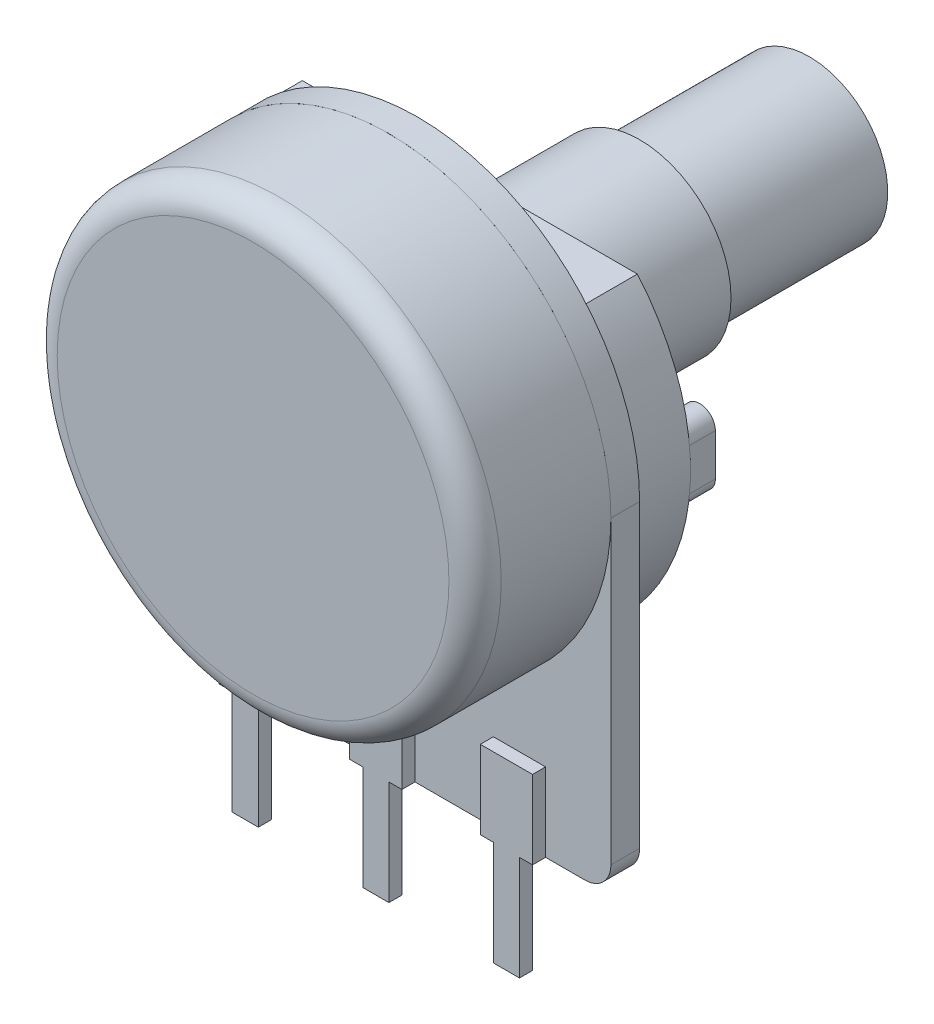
from build123d import *

# Parameters (mm, degrees)
SKETCH_1_R          = 8.5
EXTRUDE_1_DEPTH     = 5.2
FILLET_1_R          = 1
EXTRUDE_8_DEPTH     = 1.1
FILLET_2_R          = 1
EXTRUDE_2_DEPTH     = 2
SKETCH_3_R          = 3
EXTRUDE_7_DEPTH     = 15
EXTRUDE_9_DEPTH     = 0.5
EXTRUDE_9_2_DEPTH   = 0.5
EXTRUDE_9_3_DEPTH   = 0.5
BOSS_EXTRUDE1_DEPTH = 1
SKETCH2_R           = 3.5
BOSS_EXTRUDE2_DEPTH = 6.5


with BuildPart() as part:
    # Sketch 1 → Extrude 1 (new body)
    with BuildSketch(Plane.XY):
        Circle(SKETCH_1_R)
    extrude(amount=EXTRUDE_1_DEPTH)

    # Fillet 1
    fillet_1_edges = [part.edges().sort_by_distance(p)[0] for p in [
        (-8.5, 0, 5.2),
    ]]
    fillet(fillet_1_edges, radius=FILLET_1_R)


with BuildPart() as body_2:
    # Sketch 6 → Extrude 8 (new body)
    with BuildSketch(Plane(origin=(0, 0, 0), x_dir=(-1, 0, 0), z_dir=(0, 0, -1))):
        with BuildLine():
            Line((-8.5, 0), (-8.5, -12.5))
            Line((-8.5, -12.5), (8.5, -12.5))
            Line((8.5, -12.5), (8.5, 0))
            ThreePointArc((8.5, 0), (0, 8.5), (-8.5, 0))
        make_face()
    extrude(amount=EXTRUDE_8_DEPTH)

    # Fillet 2
    fillet_2_edges = [body_2.edges().sort_by_distance(p)[0] for p in [
        (-8.5, -12.5, -0.55),
        (8.5, -12.5, -0.55),
    ]]
    fillet(fillet_2_edges, radius=FILLET_2_R)


with BuildPart() as body_3:
    # Sketch 2 → Extrude 2 (new body)
    with BuildSketch(Plane(origin=(0, 0, -1.1), x_dir=(-1, 0, 0), z_dir=(0, 0, -1))):
        with BuildLine():
            Line((6.414273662, -5.500018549), (-6.415005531, -5.500018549))
            ThreePointArc((-6.415005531, -5.500018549), (-8.45, -1.2216e-05), (-6.415021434, 5.5))
            Line((-6.415021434, 5.5), (6.414289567, 5.5))
            ThreePointArc((6.414289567, 5.5), (8.449444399, -1.2217e-05), (6.414273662, -5.500018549))
        make_face()
    extrude(amount=EXTRUDE_2_DEPTH)

    # Sketch 3 → Extrude 7 (add)
    with BuildSketch(Plane(origin=(0, 0, -1.1), x_dir=(-1, 0, 0), z_dir=(0, 0, -1))):
        Circle(SKETCH_3_R)
    extrude(amount=EXTRUDE_7_DEPTH)

    # Sketch1 → Boss-Extrude1 (add)
    with BuildSketch(Plane(origin=(0, 0, -3.1), x_dir=(-1, 0, 0), z_dir=(0, 0, -1))):
        with BuildLine():
            Line((-8.4, 0.8), (-8.4, -0.8))
            ThreePointArc((-8.4, -0.8), (-7.8, -1.4), (-7.2, -0.8))
            Line((-7.2, -0.8), (-7.2, 0.8))
            ThreePointArc((-7.2, 0.8), (-7.8, 1.4), (-8.4, 0.8))
        make_face()
    extrude(amount=BOSS_EXTRUDE1_DEPTH)

    # Sketch2 → Boss-Extrude2 (add)
    with BuildSketch(Plane(origin=(0, 0, -3.1), x_dir=(-1, 0, 0), z_dir=(0, 0, -1))):
        with Locations(Location((0, 0, 0), (0, 0, 180))):
            Circle(SKETCH2_R)
    extrude(amount=BOSS_EXTRUDE2_DEPTH)


with BuildPart() as body_4:
    # Sketch 7 → Extrude 9 (new body)
    with BuildSketch(Plane.XY):
        Polygon((-1, -9.5), (-1, -12.5), (-0.5, -12.5), (-0.5, -16.5), (0.5, -16.5), (0.5, -12.5), (1, -12.5), (1, -9.5), align=None)
    extrude(amount=EXTRUDE_9_DEPTH)


with BuildPart() as body_5:
    # Sketch 7 → Extrude 9 2 (new body)
    with BuildSketch(Plane.XY):
        Polygon((-6, -12.5), (-5.5, -12.5), (-5.5, -16.5), (-4.5, -16.5), (-4.5, -12.5), (-4, -12.5), (-4, -9.5), (-6, -9.5), align=None)
    extrude(amount=EXTRUDE_9_2_DEPTH)


with BuildPart() as body_6:
    # Sketch 7 → Extrude 9 3 (new body)
    with BuildSketch(Plane.XY):
        Polygon((4, -12.5), (4.5, -12.5), (4.5, -16.5), (5.5, -16.5), (5.5, -12.5), (6, -12.5), (6, -9.5), (4, -9.5), align=None)
    extrude(amount=EXTRUDE_9_3_DEPTH)


solid = Compound([part.part, body_2.part, body_3.part, body_4.part, body_5.part, body_6.part])
